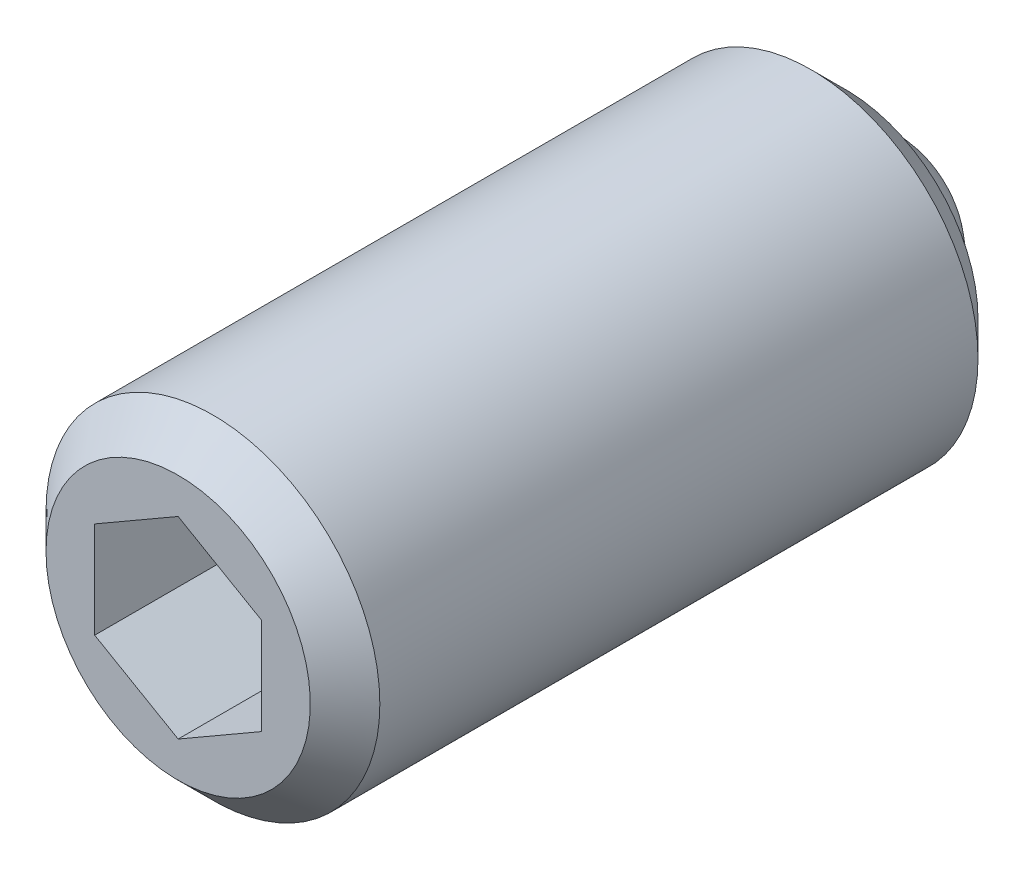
ISO-10303-21;
HEADER;
FILE_DESCRIPTION(('STEP AP214'),'2;1');
FILE_NAME('part.step','',(''),(''),'','','');
FILE_SCHEMA(('AUTOMOTIVE_DESIGN { 1 0 10303 214 1 1 1 1 }'));
ENDSEC;
DATA;
#1=APPLICATION_CONTEXT('core data for automotive mechanical design processes');
#2=APPLICATION_PROTOCOL_DEFINITION('international standard','automotive_design',2000,#1);
#3=PRODUCT_CONTEXT('',#1,'mechanical');
#4=PRODUCT('Part','Part','',(#3));
#5=PRODUCT_RELATED_PRODUCT_CATEGORY('part','',(#4));
#6=PRODUCT_DEFINITION_FORMATION('','',#4);
#7=PRODUCT_DEFINITION_CONTEXT('part definition',#1,'design');
#8=PRODUCT_DEFINITION('design','',#6,#7);
#9=PRODUCT_DEFINITION_SHAPE('','',#8);
#10=(LENGTH_UNIT() NAMED_UNIT(*) SI_UNIT(.MILLI.,.METRE.));
#11=(NAMED_UNIT(*) PLANE_ANGLE_UNIT() SI_UNIT($,.RADIAN.));
#12=(NAMED_UNIT(*) SI_UNIT($,.STERADIAN.) SOLID_ANGLE_UNIT());
#13=UNCERTAINTY_MEASURE_WITH_UNIT(LENGTH_MEASURE(1.E-05),#10,'distance_accuracy_value','');
#14=(GEOMETRIC_REPRESENTATION_CONTEXT(3) GLOBAL_UNCERTAINTY_ASSIGNED_CONTEXT((#13)) GLOBAL_UNIT_ASSIGNED_CONTEXT((#10,
#11,#12)) REPRESENTATION_CONTEXT('',''));
#15=CARTESIAN_POINT('',(0.,0.,0.));
#16=DIRECTION('',(0.,0.,1.));
#17=DIRECTION('',(1.,0.,0.));
#18=AXIS2_PLACEMENT_3D('',#15,#16,#17);
#19=CARTESIAN_POINT('',(3.07199994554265,8.7018232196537,43.4999999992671));
#20=DIRECTION('',(-2.38582419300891E-10,0.,-1.));
#21=DIRECTION('',(0.499999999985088,-0.866025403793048,-1.19291902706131E-10));
#22=AXIS2_PLACEMENT_3D('',#19,#20,#21);
#23=PLANE('',#22);
#24=DIRECTION('',(0.86602540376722,-0.500000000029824,-2.06618836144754E-10));
#25=VECTOR('',#24,1.);
#26=CARTESIAN_POINT('',(-3.00000005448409,-5.19615246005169,43.5000000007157));
#27=LINE('',#26,#25);
#28=CARTESIAN_POINT('',(-6.0000000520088,-3.46410165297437,43.5000000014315));
#29=VERTEX_POINT('',#28);
#30=CARTESIAN_POINT('',(-5.38809140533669E-08,-6.92820326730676,43.5));
#31=VERTEX_POINT('',#30);
#32=EDGE_CURVE('E77',#29,#31,#27,.T.);
#33=ORIENTED_EDGE('',*,*,#32,.T.);
#34=DIRECTION('',(0.866025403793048,0.499999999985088,-2.06618035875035E-10));
#35=VECTOR('',#34,1.);
#36=CARTESIAN_POINT('',(2.99999994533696,-5.19615246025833,43.4999999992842));
#37=LINE('',#36,#35);
#38=CARTESIAN_POINT('',(5.99999994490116,-3.46410165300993,43.4999999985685));
#39=VERTEX_POINT('',#38);
#40=EDGE_CURVE('E72',#31,#39,#37,.T.);
#41=ORIENTED_EDGE('',*,*,#40,.T.);
#42=DIRECTION('',(0.,1.,0.));
#43=VECTOR('',#42,1.);
#44=CARTESIAN_POINT('',(5.99999994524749,-3.7706664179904E-08,43.4999999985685));
#45=LINE('',#44,#43);
#46=CARTESIAN_POINT('',(5.99999994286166,3.4641015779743,43.4999999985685));
#47=VERTEX_POINT('',#46);
#48=EDGE_CURVE('E74',#39,#47,#45,.T.);
#49=ORIENTED_EDGE('',*,*,#48,.T.);
#50=DIRECTION('',(-0.86602540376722,0.500000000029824,2.06618836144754E-10));
#51=VECTOR('',#50,1.);
#52=CARTESIAN_POINT('',(2.99999994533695,5.19615238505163,43.4999999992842));
#53=LINE('',#52,#51);
#54=CARTESIAN_POINT('',(-5.49198980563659E-08,6.92820319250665,43.5));
#55=VERTEX_POINT('',#54);
#56=EDGE_CURVE('E90',#47,#55,#53,.T.);
#57=ORIENTED_EDGE('',*,*,#56,.T.);
#58=DIRECTION('',(-0.866025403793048,-0.499999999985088,2.06618035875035E-10));
#59=VECTOR('',#58,1.);
#60=CARTESIAN_POINT('',(-3.0000000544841,5.19615238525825,43.5000000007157));
#61=LINE('',#60,#59);
#62=CARTESIAN_POINT('',(-6.0000000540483,3.46410157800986,43.5000000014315));
#63=VERTEX_POINT('',#62);
#64=EDGE_CURVE('E96',#55,#63,#61,.T.);
#65=ORIENTED_EDGE('',*,*,#64,.T.);
#66=DIRECTION('',(0.,-1.,0.));
#67=VECTOR('',#66,1.);
#68=CARTESIAN_POINT('',(-6.00000005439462,-3.72934040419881E-08,43.5000000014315));
#69=LINE('',#68,#67);
#70=EDGE_CURVE('E99',#63,#29,#69,.T.);
#71=ORIENTED_EDGE('',*,*,#70,.T.);
#72=EDGE_LOOP('',(#33,#41,#49,#57,#65,#71));
#73=FACE_BOUND('',#72,.T.);
#74=ADVANCED_FACE('F14',(#73),#23,.F.);
#75=CARTESIAN_POINT('',(5.99999994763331,-3.46410165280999,53.4999999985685));
#76=DIRECTION('',(0.499999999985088,-0.866025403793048,-1.19291902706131E-10));
#77=DIRECTION('',(-0.866025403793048,-0.499999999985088,2.06618035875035E-10));
#78=AXIS2_PLACEMENT_3D('',#75,#76,#77);
#79=PLANE('',#78);
#80=DIRECTION('',(-2.38582419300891E-10,0.,-1.));
#81=VECTOR('',#80,1.);
#82=CARTESIAN_POINT('',(5.9999999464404,-3.46410165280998,48.4999999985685));
#83=LINE('',#82,#81);
#84=CARTESIAN_POINT('',(5.99999994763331,-3.46410164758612,53.4999999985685));
#85=VERTEX_POINT('',#84);
#86=EDGE_CURVE('E78',#85,#39,#83,.T.);
#87=ORIENTED_EDGE('',*,*,#86,.T.);
#88=ORIENTED_EDGE('',*,*,#40,.F.);
#89=DIRECTION('',(2.38582419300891E-10,0.,1.));
#90=VECTOR('',#89,1.);
#91=CARTESIAN_POINT('',(-5.3380660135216E-08,-6.92820326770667,48.5));
#92=LINE('',#91,#90);
#93=CARTESIAN_POINT('',(-5.67117438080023E-08,-6.92820326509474,53.5));
#94=VERTEX_POINT('',#93);
#95=EDGE_CURVE('E52',#31,#94,#92,.T.);
#96=ORIENTED_EDGE('',*,*,#95,.T.);
#97=DIRECTION('',(0.866025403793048,0.499999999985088,-2.06618035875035E-10));
#98=VECTOR('',#97,1.);
#99=CARTESIAN_POINT('',(2.99999994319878,-5.19615245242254,53.4999999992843));
#100=LINE('',#99,#98);
#101=EDGE_CURVE('E46',#94,#85,#100,.T.);
#102=ORIENTED_EDGE('',*,*,#101,.T.);
#103=EDGE_LOOP('',(#87,#88,#96,#102));
#104=FACE_BOUND('',#103,.T.);
#105=ADVANCED_FACE('F81',(#104),#79,.F.);
#106=CARTESIAN_POINT('',(5.99999994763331,3.46410157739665,53.4999999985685));
#107=DIRECTION('',(1.,0.,-2.38582419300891E-10));
#108=DIRECTION('',(0.,-1.,0.));
#109=AXIS2_PLACEMENT_3D('',#106,#107,#108);
#110=PLANE('',#109);
#111=DIRECTION('',(-2.38582419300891E-10,0.,-1.));
#112=VECTOR('',#111,1.);
#113=CARTESIAN_POINT('',(5.9999999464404,3.46410157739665,48.4999999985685));
#114=LINE('',#113,#112);
#115=CARTESIAN_POINT('',(5.99999994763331,3.46410157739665,53.4999999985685));
#116=VERTEX_POINT('',#115);
#117=EDGE_CURVE('E87',#116,#47,#114,.T.);
#118=ORIENTED_EDGE('',*,*,#117,.T.);
#119=ORIENTED_EDGE('',*,*,#48,.F.);
#120=ORIENTED_EDGE('',*,*,#86,.F.);
#121=DIRECTION('',(0.,-1.,0.));
#122=VECTOR('',#121,1.);
#123=CARTESIAN_POINT('',(5.99999994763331,3.46410157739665,53.4999999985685));
#124=LINE('',#123,#122);
#125=EDGE_CURVE('E111',#85,#116,#124,.F.);
#126=ORIENTED_EDGE('',*,*,#125,.T.);
#127=EDGE_LOOP('',(#118,#119,#120,#126));
#128=FACE_BOUND('',#127,.T.);
#129=ADVANCED_FACE('F85',(#128),#110,.F.);
#130=CARTESIAN_POINT('',(-5.2187746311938E-08,6.92820319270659,53.5));
#131=DIRECTION('',(0.500000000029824,0.86602540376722,-1.19290516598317E-10));
#132=DIRECTION('',(0.86602540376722,-0.500000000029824,-2.06618836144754E-10));
#133=AXIS2_PLACEMENT_3D('',#130,#131,#132);
#134=PLANE('',#133);
#135=DIRECTION('',(-2.38582419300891E-10,0.,-1.));
#136=VECTOR('',#135,1.);
#137=CARTESIAN_POINT('',(-5.33806605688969E-08,6.9282031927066,48.5));
#138=LINE('',#137,#136);
#139=CARTESIAN_POINT('',(-4.7663747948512E-08,6.92820319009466,53.5));
#140=VERTEX_POINT('',#139);
#141=EDGE_CURVE('E95',#140,#55,#138,.T.);
#142=ORIENTED_EDGE('',*,*,#141,.T.);
#143=ORIENTED_EDGE('',*,*,#56,.F.);
#144=ORIENTED_EDGE('',*,*,#117,.F.);
#145=DIRECTION('',(0.86602540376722,-0.500000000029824,-2.06618836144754E-10));
#146=VECTOR('',#145,1.);
#147=CARTESIAN_POINT('',(-5.2187746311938E-08,6.92820319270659,53.5));
#148=LINE('',#147,#146);
#149=EDGE_CURVE('E105',#116,#140,#148,.F.);
#150=ORIENTED_EDGE('',*,*,#149,.T.);
#151=EDGE_LOOP('',(#142,#143,#144,#150));
#152=FACE_BOUND('',#151,.T.);
#153=ADVANCED_FACE('F152',(#152),#134,.F.);
#154=CARTESIAN_POINT('',(-6.0000000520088,3.4641015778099,53.5000000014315));
#155=DIRECTION('',(-0.499999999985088,0.866025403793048,1.19291902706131E-10));
#156=DIRECTION('',(0.866025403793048,0.499999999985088,-2.06618035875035E-10));
#157=AXIS2_PLACEMENT_3D('',#154,#155,#156);
#158=PLANE('',#157);
#159=DIRECTION('',(-2.38582419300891E-10,0.,-1.));
#160=VECTOR('',#159,1.);
#161=CARTESIAN_POINT('',(-6.00000005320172,3.46410157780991,48.5000000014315));
#162=LINE('',#161,#160);
#163=CARTESIAN_POINT('',(-6.0000000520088,3.46410157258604,53.5000000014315));
#164=VERTEX_POINT('',#163);
#165=EDGE_CURVE('E98',#164,#63,#162,.T.);
#166=ORIENTED_EDGE('',*,*,#165,.T.);
#167=ORIENTED_EDGE('',*,*,#64,.F.);
#168=ORIENTED_EDGE('',*,*,#141,.F.);
#169=DIRECTION('',(-0.866025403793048,-0.499999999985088,2.06618035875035E-10));
#170=VECTOR('',#169,1.);
#171=CARTESIAN_POINT('',(-3.00000004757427,5.19615237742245,53.5000000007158));
#172=LINE('',#171,#170);
#173=EDGE_CURVE('E103',#140,#164,#172,.T.);
#174=ORIENTED_EDGE('',*,*,#173,.T.);
#175=EDGE_LOOP('',(#166,#167,#168,#174));
#176=FACE_BOUND('',#175,.T.);
#177=ADVANCED_FACE('F150',(#176),#158,.F.);
#178=CARTESIAN_POINT('',(-6.0000000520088,-3.46410165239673,53.5000000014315));
#179=DIRECTION('',(-1.,0.,2.38582419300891E-10));
#180=DIRECTION('',(0.,1.,0.));
#181=AXIS2_PLACEMENT_3D('',#178,#179,#180);
#182=PLANE('',#181);
#183=DIRECTION('',(-2.38582419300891E-10,0.,-1.));
#184=VECTOR('',#183,1.);
#185=CARTESIAN_POINT('',(-6.00000005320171,-3.46410165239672,48.5000000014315));
#186=LINE('',#185,#184);
#187=CARTESIAN_POINT('',(-6.0000000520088,-3.46410165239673,53.5000000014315));
#188=VERTEX_POINT('',#187);
#189=EDGE_CURVE('E101',#188,#29,#186,.T.);
#190=ORIENTED_EDGE('',*,*,#189,.T.);
#191=ORIENTED_EDGE('',*,*,#70,.F.);
#192=ORIENTED_EDGE('',*,*,#165,.F.);
#193=DIRECTION('',(0.,1.,0.));
#194=VECTOR('',#193,1.);
#195=CARTESIAN_POINT('',(-6.0000000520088,-3.46410165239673,53.5000000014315));
#196=LINE('',#195,#194);
#197=EDGE_CURVE('E31',#164,#188,#196,.F.);
#198=ORIENTED_EDGE('',*,*,#197,.T.);
#199=EDGE_LOOP('',(#190,#191,#192,#198));
#200=FACE_BOUND('',#199,.T.);
#201=ADVANCED_FACE('F146',(#200),#182,.F.);
#202=CARTESIAN_POINT('',(-5.21877458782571E-08,-6.92820326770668,53.5));
#203=DIRECTION('',(-0.500000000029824,-0.86602540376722,1.19290516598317E-10));
#204=DIRECTION('',(-0.86602540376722,0.500000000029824,2.06618836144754E-10));
#205=AXIS2_PLACEMENT_3D('',#202,#203,#204);
#206=PLANE('',#205);
#207=ORIENTED_EDGE('',*,*,#95,.F.);
#208=ORIENTED_EDGE('',*,*,#32,.F.);
#209=ORIENTED_EDGE('',*,*,#189,.F.);
#210=DIRECTION('',(-0.86602540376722,0.500000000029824,2.06618836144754E-10));
#211=VECTOR('',#210,1.);
#212=CARTESIAN_POINT('',(-5.21877458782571E-08,-6.92820326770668,53.5));
#213=LINE('',#212,#211);
#214=EDGE_CURVE('E114',#188,#94,#213,.F.);
#215=ORIENTED_EDGE('',*,*,#214,.T.);
#216=EDGE_LOOP('',(#207,#208,#209,#215));
#217=FACE_BOUND('',#216,.T.);
#218=ADVANCED_FACE('F139',(#217),#206,.F.);
#219=CARTESIAN_POINT('',(3.54761758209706,13.1495089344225,53.4999999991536));
#220=DIRECTION('',(-2.38582419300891E-10,0.,-1.));
#221=DIRECTION('',(0.499999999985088,-0.866025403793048,-1.19291902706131E-10));
#222=AXIS2_PLACEMENT_3D('',#219,#220,#221);
#223=PLANE('',#222);
#224=CARTESIAN_POINT('',(1.27641594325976E-08,0.,53.5));
#225=DIRECTION('',(-2.38582419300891E-10,0.,-1.));
#226=DIRECTION('',(-1.,0.,2.38582419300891E-10));
#227=AXIS2_PLACEMENT_3D('',#224,#225,#226);
#228=CIRCLE('',#227,9.5);
#229=CARTESIAN_POINT('',(-9.49999998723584,0.,53.5000000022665));
#230=VERTEX_POINT('',#229);
#231=EDGE_CURVE('E116',#230,#230,#228,.F.);
#232=ORIENTED_EDGE('',*,*,#231,.T.);
#233=EDGE_LOOP('',(#232));
#234=FACE_BOUND('',#233,.T.);
#235=ORIENTED_EDGE('',*,*,#197,.F.);
#236=ORIENTED_EDGE('',*,*,#173,.F.);
#237=ORIENTED_EDGE('',*,*,#149,.F.);
#238=ORIENTED_EDGE('',*,*,#125,.F.);
#239=ORIENTED_EDGE('',*,*,#101,.F.);
#240=ORIENTED_EDGE('',*,*,#214,.F.);
#241=EDGE_LOOP('',(#235,#236,#237,#238,#239,#240));
#242=FACE_BOUND('',#241,.T.);
#243=ADVANCED_FACE('F136',(#234,#242),#223,.F.);
#244=CARTESIAN_POINT('',(-6.7855525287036E-09,0.,-28.4411254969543));
#245=DIRECTION('',(2.38582419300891E-10,0.,1.));
#246=DIRECTION('',(1.,0.,-2.38582419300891E-10));
#247=AXIS2_PLACEMENT_3D('',#244,#245,#246);
#248=CYLINDRICAL_SURFACE('',#247,12.);
#249=CARTESIAN_POINT('',(1.21677033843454E-08,0.,51.));
#250=DIRECTION('',(-2.38582419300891E-10,0.,-1.));
#251=DIRECTION('',(-1.,0.,2.38582419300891E-10));
#252=AXIS2_PLACEMENT_3D('',#249,#250,#251);
#253=CIRCLE('',#252,12.);
#254=CARTESIAN_POINT('',(-11.9999999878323,0.,51.000000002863));
#255=VERTEX_POINT('',#254);
#256=EDGE_CURVE('E23',#255,#255,#253,.T.);
#257=ORIENTED_EDGE('',*,*,#256,.T.);
#258=EDGE_LOOP('',(#257));
#259=FACE_BOUND('',#258,.T.);
#260=CARTESIAN_POINT('',(1.90865935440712E-09,0.,8.));
#261=DIRECTION('',(2.38582419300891E-10,0.,1.));
#262=DIRECTION('',(1.,0.,-2.38582419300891E-10));
#263=AXIS2_PLACEMENT_3D('',#260,#261,#262);
#264=CIRCLE('',#263,12.);
#265=CARTESIAN_POINT('',(12.0000000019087,0.,7.99999999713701));
#266=VERTEX_POINT('',#265);
#267=EDGE_CURVE('E122',#266,#266,#264,.T.);
#268=ORIENTED_EDGE('',*,*,#267,.T.);
#269=EDGE_LOOP('',(#268));
#270=FACE_BOUND('',#269,.T.);
#271=ADVANCED_FACE('F127',(#259,#270),#248,.T.);
#272=CARTESIAN_POINT('',(0.,0.,7.5));
#273=DIRECTION('',(0.,0.,-1.));
#274=DIRECTION('',(-1.,0.,0.));
#275=AXIS2_PLACEMENT_3D('',#272,#273,#274);
#276=SPHERICAL_SURFACE('',#275,7.5);
#277=CARTESIAN_POINT('',(0.,0.,5.50000000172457));
#278=DIRECTION('',(0.,0.,-1.));
#279=DIRECTION('',(-1.,0.,0.));
#280=AXIS2_PLACEMENT_3D('',#277,#278,#279);
#281=CIRCLE('',#280,7.22841614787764);
#282=CARTESIAN_POINT('',(-7.22841614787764,0.,5.50000000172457));
#283=VERTEX_POINT('',#282);
#284=EDGE_CURVE('E79',#283,#283,#281,.T.);
#285=ORIENTED_EDGE('',*,*,#284,.T.);
#286=EDGE_LOOP('',(#285));
#287=FACE_BOUND('',#286,.T.);
#288=ADVANCED_FACE('F185',(#287),#276,.T.);
#289=CARTESIAN_POINT('',(13.1616175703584,-3.50242752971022,5.49999999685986));
#290=DIRECTION('',(2.38582419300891E-10,0.,1.));
#291=DIRECTION('',(-0.499999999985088,0.866025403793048,1.19291902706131E-10));
#292=AXIS2_PLACEMENT_3D('',#289,#290,#291);
#293=PLANE('',#292);
#294=CARTESIAN_POINT('',(1.3122033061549E-09,0.,5.5));
#295=DIRECTION('',(2.38582419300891E-10,0.,1.));
#296=DIRECTION('',(1.,0.,-2.38582419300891E-10));
#297=AXIS2_PLACEMENT_3D('',#294,#295,#296);
#298=CIRCLE('',#297,9.5);
#299=CARTESIAN_POINT('',(9.5000000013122,0.,5.49999999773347));
#300=VERTEX_POINT('',#299);
#301=EDGE_CURVE('E9',#300,#300,#298,.F.);
#302=ORIENTED_EDGE('',*,*,#301,.T.);
#303=EDGE_LOOP('',(#302));
#304=FACE_BOUND('',#303,.T.);
#305=ORIENTED_EDGE('',*,*,#284,.F.);
#306=EDGE_LOOP('',(#305));
#307=FACE_BOUND('',#306,.T.);
#308=ADVANCED_FACE('F133',(#304,#307),#293,.F.);
#309=CARTESIAN_POINT('',(1.27641594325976E-08,0.,53.5));
#310=DIRECTION('',(-2.38582419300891E-10,0.,-1.));
#311=DIRECTION('',(-1.,0.,2.38582419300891E-10));
#312=AXIS2_PLACEMENT_3D('',#309,#310,#311);
#313=CONICAL_SURFACE('',#312,9.5,0.785398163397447);
#314=ORIENTED_EDGE('',*,*,#256,.F.);
#315=EDGE_LOOP('',(#314));
#316=FACE_BOUND('',#315,.T.);
#317=ORIENTED_EDGE('',*,*,#231,.F.);
#318=EDGE_LOOP('',(#317));
#319=FACE_BOUND('',#318,.T.);
#320=ADVANCED_FACE('F130',(#316,#319),#313,.T.);
#321=CARTESIAN_POINT('',(1.3122033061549E-09,0.,5.5));
#322=DIRECTION('',(2.38582419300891E-10,0.,1.));
#323=DIRECTION('',(1.,0.,-2.38582419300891E-10));
#324=AXIS2_PLACEMENT_3D('',#321,#322,#323);
#325=CONICAL_SURFACE('',#324,9.5,0.785398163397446);
#326=ORIENTED_EDGE('',*,*,#267,.F.);
#327=EDGE_LOOP('',(#326));
#328=FACE_BOUND('',#327,.T.);
#329=ORIENTED_EDGE('',*,*,#301,.F.);
#330=EDGE_LOOP('',(#329));
#331=FACE_BOUND('',#330,.T.);
#332=ADVANCED_FACE('F16',(#328,#331),#325,.T.);
#333=CLOSED_SHELL('',(#74,#105,#129,#153,#177,#201,#218,#243,#271,#288,#308,#320,#332));
#334=MANIFOLD_SOLID_BREP('B1',#333);
#335=ADVANCED_BREP_SHAPE_REPRESENTATION('',(#18,#334),#14);
#336=SHAPE_DEFINITION_REPRESENTATION(#9,#335);
ENDSEC;
END-ISO-10303-21;
